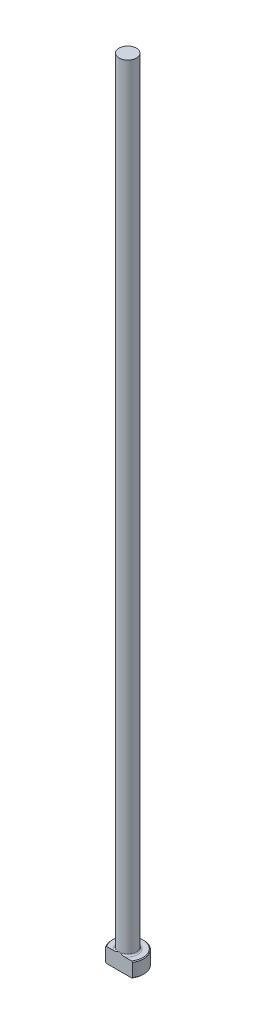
ISO-10303-21;
HEADER;
FILE_DESCRIPTION(('STEP AP214'),'2;1');
FILE_NAME('part.step','',(''),(''),'','','');
FILE_SCHEMA(('AUTOMOTIVE_DESIGN { 1 0 10303 214 1 1 1 1 }'));
ENDSEC;
DATA;
#1=APPLICATION_CONTEXT('core data for automotive mechanical design processes');
#2=APPLICATION_PROTOCOL_DEFINITION('international standard','automotive_design',2000,#1);
#3=PRODUCT_CONTEXT('',#1,'mechanical');
#4=PRODUCT('Part','Part','',(#3));
#5=PRODUCT_RELATED_PRODUCT_CATEGORY('part','',(#4));
#6=PRODUCT_DEFINITION_FORMATION('','',#4);
#7=PRODUCT_DEFINITION_CONTEXT('part definition',#1,'design');
#8=PRODUCT_DEFINITION('design','',#6,#7);
#9=PRODUCT_DEFINITION_SHAPE('','',#8);
#10=(LENGTH_UNIT() NAMED_UNIT(*) SI_UNIT(.MILLI.,.METRE.));
#11=(NAMED_UNIT(*) PLANE_ANGLE_UNIT() SI_UNIT($,.RADIAN.));
#12=(NAMED_UNIT(*) SI_UNIT($,.STERADIAN.) SOLID_ANGLE_UNIT());
#13=UNCERTAINTY_MEASURE_WITH_UNIT(LENGTH_MEASURE(1.E-05),#10,'distance_accuracy_value','');
#14=(GEOMETRIC_REPRESENTATION_CONTEXT(3) GLOBAL_UNCERTAINTY_ASSIGNED_CONTEXT((#13)) GLOBAL_UNIT_ASSIGNED_CONTEXT((#10,
#11,#12)) REPRESENTATION_CONTEXT('',''));
#15=CARTESIAN_POINT('',(0.,0.,0.));
#16=DIRECTION('',(0.,0.,1.));
#17=DIRECTION('',(1.,0.,0.));
#18=AXIS2_PLACEMENT_3D('',#15,#16,#17);
#19=CARTESIAN_POINT('',(0.,0.,0.));
#20=DIRECTION('',(0.,-1.,0.));
#21=DIRECTION('',(0.,0.,-1.));
#22=AXIS2_PLACEMENT_3D('',#19,#20,#21);
#23=PLANE('',#22);
#24=CARTESIAN_POINT('',(0.,0.,0.));
#25=DIRECTION('',(0.,-1.,0.));
#26=DIRECTION('',(0.,0.,-1.));
#27=AXIS2_PLACEMENT_3D('',#24,#25,#26);
#28=CIRCLE('',#27,4.9022);
#29=CARTESIAN_POINT('',(-4.03944478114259,0.,2.77748999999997));
#30=VERTEX_POINT('',#29);
#31=CARTESIAN_POINT('',(4.03944478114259,0.,2.77748999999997));
#32=VERTEX_POINT('',#31);
#33=EDGE_CURVE('E98',#30,#32,#28,.T.);
#34=ORIENTED_EDGE('',*,*,#33,.T.);
#35=DIRECTION('',(-1.,0.,0.));
#36=VECTOR('',#35,1.);
#37=CARTESIAN_POINT('',(-4.34418550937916,0.,2.77748999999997));
#38=LINE('',#37,#36);
#39=EDGE_CURVE('E83',#32,#30,#38,.T.);
#40=ORIENTED_EDGE('',*,*,#39,.T.);
#41=EDGE_LOOP('',(#34,#40));
#42=FACE_BOUND('',#41,.T.);
#43=ADVANCED_FACE('F32',(#42),#23,.T.);
#44=CARTESIAN_POINT('',(0.,259.958771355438,0.));
#45=DIRECTION('',(0.,1.,0.));
#46=DIRECTION('',(0.,0.,1.));
#47=AXIS2_PLACEMENT_3D('',#44,#45,#46);
#48=CYLINDRICAL_SURFACE('',#47,5.15619999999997);
#49=CARTESIAN_POINT('',(0.,4.49579999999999,0.));
#50=DIRECTION('',(0.,1.,0.));
#51=DIRECTION('',(0.,0.,1.));
#52=AXIS2_PLACEMENT_3D('',#49,#50,#51);
#53=CIRCLE('',#52,5.15619999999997);
#54=CARTESIAN_POINT('',(-4.34418550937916,4.49579999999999,2.77748999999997));
#55=VERTEX_POINT('',#54);
#56=CARTESIAN_POINT('',(4.34418550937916,4.49579999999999,2.77748999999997));
#57=VERTEX_POINT('',#56);
#58=EDGE_CURVE('E104',#55,#57,#53,.F.);
#59=ORIENTED_EDGE('',*,*,#58,.T.);
#60=DIRECTION('',(0.,-1.,0.));
#61=VECTOR('',#60,1.);
#62=CARTESIAN_POINT('',(4.34418550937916,254.,2.77748999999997));
#63=LINE('',#62,#61);
#64=CARTESIAN_POINT('',(4.34418550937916,0.253999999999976,2.77748999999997));
#65=VERTEX_POINT('',#64);
#66=EDGE_CURVE('E183',#57,#65,#63,.T.);
#67=ORIENTED_EDGE('',*,*,#66,.T.);
#68=CARTESIAN_POINT('',(0.,0.253999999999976,0.));
#69=DIRECTION('',(0.,-1.,0.));
#70=DIRECTION('',(0.,0.,-1.));
#71=AXIS2_PLACEMENT_3D('',#68,#69,#70);
#72=CIRCLE('',#71,5.15619999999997);
#73=CARTESIAN_POINT('',(-4.34418550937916,0.253999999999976,2.77748999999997));
#74=VERTEX_POINT('',#73);
#75=EDGE_CURVE('E100',#65,#74,#72,.F.);
#76=ORIENTED_EDGE('',*,*,#75,.T.);
#77=DIRECTION('',(0.,-1.,0.));
#78=VECTOR('',#77,1.);
#79=CARTESIAN_POINT('',(-4.34418550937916,254.,2.77748999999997));
#80=LINE('',#79,#78);
#81=EDGE_CURVE('E93',#55,#74,#80,.T.);
#82=ORIENTED_EDGE('',*,*,#81,.F.);
#83=EDGE_LOOP('',(#59,#67,#76,#82));
#84=FACE_BOUND('',#83,.T.);
#85=ADVANCED_FACE('F158',(#84),#48,.T.);
#86=CARTESIAN_POINT('',(-5.15619999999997,4.7498,0.));
#87=DIRECTION('',(0.,1.,0.));
#88=DIRECTION('',(0.,0.,1.));
#89=AXIS2_PLACEMENT_3D('',#86,#87,#88);
#90=PLANE('',#89);
#91=CARTESIAN_POINT('',(0.,4.7498,0.));
#92=DIRECTION('',(0.,1.,0.));
#93=DIRECTION('',(0.,0.,1.));
#94=AXIS2_PLACEMENT_3D('',#91,#92,#93);
#95=CIRCLE('',#94,4.90220000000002);
#96=CARTESIAN_POINT('',(4.03944478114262,4.7498,2.77748999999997));
#97=VERTEX_POINT('',#96);
#98=CARTESIAN_POINT('',(-4.03944478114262,4.7498,2.77748999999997));
#99=VERTEX_POINT('',#98);
#100=EDGE_CURVE('E178',#97,#99,#95,.T.);
#101=ORIENTED_EDGE('',*,*,#100,.T.);
#102=DIRECTION('',(1.,0.,0.));
#103=VECTOR('',#102,1.);
#104=CARTESIAN_POINT('',(-5.15619999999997,4.7498,2.77748999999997));
#105=LINE('',#104,#103);
#106=CARTESIAN_POINT('',(-1.75499112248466,4.74979999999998,2.77748999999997));
#107=VERTEX_POINT('',#106);
#108=EDGE_CURVE('E57',#99,#107,#105,.T.);
#109=ORIENTED_EDGE('',*,*,#108,.T.);
#110=CARTESIAN_POINT('',(0.,4.7498,0.));
#111=DIRECTION('',(0.,1.,0.));
#112=DIRECTION('',(0.,0.,1.));
#113=AXIS2_PLACEMENT_3D('',#110,#111,#112);
#114=CIRCLE('',#113,3.28548999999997);
#115=CARTESIAN_POINT('',(1.75499112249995,4.74979999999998,2.77748999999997));
#116=VERTEX_POINT('',#115);
#117=EDGE_CURVE('E107',#107,#116,#114,.F.);
#118=ORIENTED_EDGE('',*,*,#117,.T.);
#119=EDGE_CURVE('E136',#116,#97,#105,.T.);
#120=ORIENTED_EDGE('',*,*,#119,.T.);
#121=EDGE_LOOP('',(#101,#109,#118,#120));
#122=FACE_BOUND('',#121,.T.);
#123=ADVANCED_FACE('F147',(#122),#90,.T.);
#124=CARTESIAN_POINT('',(0.,4.74980000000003,0.));
#125=DIRECTION('',(0.,-1.,0.));
#126=DIRECTION('',(0.,0.,-1.));
#127=AXIS2_PLACEMENT_3D('',#124,#125,#126);
#128=CONICAL_SURFACE('',#127,4.9022,0.785398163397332);
#129=ORIENTED_EDGE('',*,*,#58,.F.);
#130=CARTESIAN_POINT('',(-9.55963531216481,-0.302952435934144,2.77748999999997));
#131=CARTESIAN_POINT('',(-9.37135034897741,-0.122152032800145,2.77748999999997));
#132=CARTESIAN_POINT('',(-9.18286469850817,0.0584399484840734,2.77748999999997));
#133=CARTESIAN_POINT('',(-8.80539641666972,0.419106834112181,2.77748999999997));
#134=CARTESIAN_POINT('',(-8.61641378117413,0.599181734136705,2.77748999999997));
#135=CARTESIAN_POINT('',(-8.23780363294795,0.958763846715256,2.77748999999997));
#136=CARTESIAN_POINT('',(-8.04817594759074,1.13827087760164,2.77748999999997));
#137=CARTESIAN_POINT('',(-7.66820393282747,1.49652400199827,2.77748999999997));
#138=CARTESIAN_POINT('',(-7.47785960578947,1.67527009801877,2.77748999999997));
#139=CARTESIAN_POINT('',(-7.09861750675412,2.02964380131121,2.77748999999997));
#140=CARTESIAN_POINT('',(-6.90973042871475,2.20528284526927,2.77748999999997));
#141=CARTESIAN_POINT('',(-6.53088645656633,2.55540305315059,2.77748999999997));
#142=CARTESIAN_POINT('',(-6.34092956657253,2.72988422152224,2.77748999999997));
#143=CARTESIAN_POINT('',(-5.95968564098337,3.07734070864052,2.77748999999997));
#144=CARTESIAN_POINT('',(-5.76839877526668,3.25031621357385,2.77748999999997));
#145=CARTESIAN_POINT('',(-5.3840855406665,3.59432147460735,2.77748999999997));
#146=CARTESIAN_POINT('',(-5.19105920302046,3.7653512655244,2.77748999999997));
#147=CARTESIAN_POINT('',(-4.84259460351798,4.06992471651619,2.77748999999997));
#148=CARTESIAN_POINT('',(-4.6875797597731,4.20395211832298,2.77748999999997));
#149=CARTESIAN_POINT('',(-4.37569692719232,4.46986504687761,2.77748999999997));
#150=CARTESIAN_POINT('',(-4.21882878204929,4.60175039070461,2.77748999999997));
#151=CARTESIAN_POINT('',(-3.90151974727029,4.86365914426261,2.77748999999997));
#152=CARTESIAN_POINT('',(-3.74106073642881,4.99366069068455,2.77748999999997));
#153=CARTESIAN_POINT('',(-3.41702456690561,5.24965567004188,2.77748999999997));
#154=CARTESIAN_POINT('',(-3.25344811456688,5.37564999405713,2.77748999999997));
#155=CARTESIAN_POINT('',(-2.9201807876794,5.62344221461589,2.77748999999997));
#156=CARTESIAN_POINT('',(-2.75044139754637,5.74517569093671,2.77748999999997));
#157=CARTESIAN_POINT('',(-2.49133655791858,5.92141891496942,2.77748999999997));
#158=CARTESIAN_POINT('',(-2.40416054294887,5.979142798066,2.77748999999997));
#159=CARTESIAN_POINT('',(-2.22809424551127,6.09190571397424,2.77748999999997));
#160=CARTESIAN_POINT('',(-2.13920410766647,6.14694497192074,2.77748999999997));
#161=CARTESIAN_POINT('',(-1.96016003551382,6.25324529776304,2.77748999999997));
#162=CARTESIAN_POINT('',(-1.87002259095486,6.30453380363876,2.77748999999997));
#163=CARTESIAN_POINT('',(-1.68751963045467,6.40295882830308,2.77748999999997));
#164=CARTESIAN_POINT('',(-1.59515373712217,6.45009463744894,2.77748999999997));
#165=CARTESIAN_POINT('',(-1.31465582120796,6.58349576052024,2.77748999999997));
#166=CARTESIAN_POINT('',(-1.12257968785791,6.66209225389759,2.77748999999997));
#167=CARTESIAN_POINT('',(-0.832011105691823,6.75391692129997,2.77748999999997));
#168=CARTESIAN_POINT('',(-0.737496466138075,6.77977348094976,2.77748999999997));
#169=CARTESIAN_POINT('',(-0.546475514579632,6.82278925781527,2.77748999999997));
#170=CARTESIAN_POINT('',(-0.449969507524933,6.8399497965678,2.77748999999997));
#171=CARTESIAN_POINT('',(-0.25621872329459,6.8643623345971,2.77748999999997));
#172=CARTESIAN_POINT('',(-0.158980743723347,6.87166730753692,2.77748999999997));
#173=CARTESIAN_POINT('',(0.0357279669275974,6.87598550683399,2.77748999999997));
#174=CARTESIAN_POINT('',(0.133198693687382,6.87299892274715,2.77748999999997));
#175=CARTESIAN_POINT('',(0.32694420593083,6.85699585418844,2.77748999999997));
#176=CARTESIAN_POINT('',(0.423222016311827,6.84401516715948,2.77748999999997));
#177=CARTESIAN_POINT('',(0.61411978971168,6.80897777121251,2.77748999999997));
#178=CARTESIAN_POINT('',(0.70873904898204,6.78691730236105,2.77748999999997));
#179=CARTESIAN_POINT('',(0.896435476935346,6.73483507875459,2.77748999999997));
#180=CARTESIAN_POINT('',(0.989497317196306,6.70475895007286,2.77748999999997));
#181=CARTESIAN_POINT('',(1.17322201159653,6.63810376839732,2.77748999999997));
#182=CARTESIAN_POINT('',(1.26388499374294,6.60152506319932,2.77748999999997));
#183=CARTESIAN_POINT('',(1.47746511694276,6.50797532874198,2.77748999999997));
#184=CARTESIAN_POINT('',(1.59931597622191,6.44858460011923,2.77748999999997));
#185=CARTESIAN_POINT('',(1.83913088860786,6.32236713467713,2.77748999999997));
#186=CARTESIAN_POINT('',(1.9570924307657,6.25553571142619,2.77748999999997));
#187=CARTESIAN_POINT('',(2.18997865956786,6.11622068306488,2.77748999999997));
#188=CARTESIAN_POINT('',(2.30489556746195,6.04372417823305,2.77748999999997));
#189=CARTESIAN_POINT('',(2.5319660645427,5.89460998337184,2.77748999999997));
#190=CARTESIAN_POINT('',(2.64412028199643,5.8179932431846,2.77748999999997));
#191=CARTESIAN_POINT('',(2.86729042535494,5.6608262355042,2.77748999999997));
#192=CARTESIAN_POINT('',(2.97828414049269,5.58024457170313,2.77748999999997));
#193=CARTESIAN_POINT('',(3.19840564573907,5.41657181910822,2.77748999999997));
#194=CARTESIAN_POINT('',(3.30753335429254,5.33348062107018,2.77748999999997));
#195=CARTESIAN_POINT('',(3.63230478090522,5.08151517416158,2.77748999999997));
#196=CARTESIAN_POINT('',(3.8456705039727,4.90970900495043,2.77748999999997));
#197=CARTESIAN_POINT('',(4.30277208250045,4.53251833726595,2.77748999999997));
#198=CARTESIAN_POINT('',(4.54576364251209,4.32624002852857,2.77748999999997));
#199=CARTESIAN_POINT('',(5.02789686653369,3.90921091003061,2.77748999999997));
#200=CARTESIAN_POINT('',(5.26703820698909,3.69845972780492,2.77748999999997));
#201=CARTESIAN_POINT('',(5.74277905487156,3.27371644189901,2.77748999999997));
#202=CARTESIAN_POINT('',(5.97937625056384,3.05972175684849,2.77748999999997));
#203=CARTESIAN_POINT('',(6.45056510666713,2.62953458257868,2.77748999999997));
#204=CARTESIAN_POINT('',(6.68515674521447,2.41334206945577,2.77748999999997));
#205=CARTESIAN_POINT('',(7.14123520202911,1.99009092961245,2.77748999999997));
#206=CARTESIAN_POINT('',(7.36279506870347,1.7831109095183,2.77748999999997));
#207=CARTESIAN_POINT('',(7.80485250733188,1.36801517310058,2.77748999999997));
#208=CARTESIAN_POINT('',(8.02535006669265,1.15989944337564,2.77748999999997));
#209=CARTESIAN_POINT('',(8.4652013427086,0.743063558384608,2.77748999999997));
#210=CARTESIAN_POINT('',(8.68455621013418,0.534344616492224,2.77748999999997));
#211=CARTESIAN_POINT('',(9.12257454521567,0.116191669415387,2.77748999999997));
#212=CARTESIAN_POINT('',(9.34123802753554,-0.0932423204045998,2.77748999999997));
#213=CARTESIAN_POINT('',(9.55963531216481,-0.302952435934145,2.77748999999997));
#214=B_SPLINE_CURVE_WITH_KNOTS('',3,(#130,#131,#132,#133,#134,#135,#136,#137,#138,#139,#140,
#141,#142,#143,#144,#145,#146,#147,#148,#149,#150,#151,#152,#153,#154,#155,#156,#157,#158,#159,
#160,#161,#162,#163,#164,#165,#166,#167,#168,#169,#170,#171,#172,#173,#174,#175,#176,#177,#178,
#179,#180,#181,#182,#183,#184,#185,#186,#187,#188,#189,#190,#191,#192,#193,#194,#195,#196,#197,
#198,#199,#200,#201,#202,#203,#204,#205,#206,#207,#208,#209,#210,#211,#212,#213),.UNSPECIFIED.,
.F.,.F.,(4,2,2,2,2,2,2,2,2,2,2,2,2,2,2,2,2,2,2,2,2,2,2,2,2,2,2,2,2,2,2,2,2,2,2,2,2,2,2,2,2,4),
(0.,0.783109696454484,1.56622591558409,2.3495714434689,3.13291438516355,3.90669782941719,
4.68047829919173,5.45416168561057,6.22783120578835,6.84258177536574,7.45738456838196,
8.07687494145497,8.69622658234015,9.32265693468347,9.63628229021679,9.94988129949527,
10.2608915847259,10.5719549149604,11.192167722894,11.4858060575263,11.7793997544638,
12.0714090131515,12.3634128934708,12.6543756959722,12.9454591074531,13.2385696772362,
13.5316645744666,13.9379559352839,14.3445046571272,14.752007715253,15.1594172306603,
15.5708539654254,15.9823086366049,16.8039855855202,17.7601331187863,18.7163605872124,
19.673393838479,20.6304375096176,21.5400289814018,22.4496312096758,23.3579913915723,
24.2663321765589),.UNSPECIFIED.);
#215=EDGE_CURVE('E135',#55,#99,#214,.T.);
#216=ORIENTED_EDGE('',*,*,#215,.T.);
#217=ORIENTED_EDGE('',*,*,#100,.F.);
#218=EDGE_CURVE('E127',#97,#57,#214,.T.);
#219=ORIENTED_EDGE('',*,*,#218,.T.);
#220=EDGE_LOOP('',(#129,#216,#217,#219));
#221=FACE_BOUND('',#220,.T.);
#222=ADVANCED_FACE('F143',(#221),#128,.T.);
#223=CARTESIAN_POINT('',(0.,0.253999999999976,0.));
#224=DIRECTION('',(0.,1.,0.));
#225=DIRECTION('',(0.,0.,1.));
#226=AXIS2_PLACEMENT_3D('',#223,#224,#225);
#227=CONICAL_SURFACE('',#226,5.15619999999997,0.785398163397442);
#228=ORIENTED_EDGE('',*,*,#75,.F.);
#229=CARTESIAN_POINT('',(9.55963531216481,5.05275243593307,2.77748999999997));
#230=CARTESIAN_POINT('',(9.37135034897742,4.87195203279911,2.77748999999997));
#231=CARTESIAN_POINT('',(9.18286469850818,4.69136005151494,2.77748999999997));
#232=CARTESIAN_POINT('',(8.80539641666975,4.33069316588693,2.77748999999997));
#233=CARTESIAN_POINT('',(8.61641378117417,4.15061826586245,2.77748999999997));
#234=CARTESIAN_POINT('',(8.23780363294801,3.79103615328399,2.77748999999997));
#235=CARTESIAN_POINT('',(8.0481759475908,3.61152912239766,2.77748999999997));
#236=CARTESIAN_POINT('',(7.66820393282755,3.25327599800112,2.77748999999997));
#237=CARTESIAN_POINT('',(7.47785960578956,3.07452990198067,2.77748999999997));
#238=CARTESIAN_POINT('',(7.09861750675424,2.72015619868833,2.77748999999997));
#239=CARTESIAN_POINT('',(6.90973042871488,2.54451715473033,2.77748999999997));
#240=CARTESIAN_POINT('',(6.5308864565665,2.19439694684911,2.77748999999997));
#241=CARTESIAN_POINT('',(6.34092956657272,2.01991577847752,2.77748999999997));
#242=CARTESIAN_POINT('',(5.95968564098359,1.67245929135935,2.77748999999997));
#243=CARTESIAN_POINT('',(5.76839877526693,1.49948378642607,2.77748999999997));
#244=CARTESIAN_POINT('',(5.38408554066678,1.15547852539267,2.77748999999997));
#245=CARTESIAN_POINT('',(5.19105920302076,0.984448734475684,2.77748999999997));
#246=CARTESIAN_POINT('',(4.84259460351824,0.679875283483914,2.77748999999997));
#247=CARTESIAN_POINT('',(4.68757975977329,0.545847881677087,2.77748999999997));
#248=CARTESIAN_POINT('',(4.37569692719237,0.279934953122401,2.77748999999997));
#249=CARTESIAN_POINT('',(4.21882878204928,0.148049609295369,2.77748999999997));
#250=CARTESIAN_POINT('',(3.90151974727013,-0.113859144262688,2.77748999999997));
#251=CARTESIAN_POINT('',(3.74106073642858,-0.243860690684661,2.77748999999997));
#252=CARTESIAN_POINT('',(3.41702456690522,-0.499855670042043,2.77748999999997));
#253=CARTESIAN_POINT('',(3.25344811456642,-0.625849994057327,2.77748999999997));
#254=CARTESIAN_POINT('',(2.92018078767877,-0.873642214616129,2.77748999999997));
#255=CARTESIAN_POINT('',(2.75044139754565,-0.995375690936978,2.77748999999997));
#256=CARTESIAN_POINT('',(2.49133655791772,-1.17161891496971,2.77748999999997));
#257=CARTESIAN_POINT('',(2.40416054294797,-1.2293427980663,2.77748999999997));
#258=CARTESIAN_POINT('',(2.22809424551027,-1.34210571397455,2.77748999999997));
#259=CARTESIAN_POINT('',(2.13920410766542,-1.39714497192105,2.77748999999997));
#260=CARTESIAN_POINT('',(1.96016003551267,-1.50344529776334,2.77748999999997));
#261=CARTESIAN_POINT('',(1.87002259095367,-1.55473380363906,2.77748999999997));
#262=CARTESIAN_POINT('',(1.68751963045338,-1.65315882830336,2.77748999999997));
#263=CARTESIAN_POINT('',(1.59515373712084,-1.70029463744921,2.77748999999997));
#264=CARTESIAN_POINT('',(1.31465582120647,-1.83369576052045,2.77748999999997));
#265=CARTESIAN_POINT('',(1.12257968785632,-1.91229225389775,2.77748999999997));
#266=CARTESIAN_POINT('',(0.832011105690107,-2.0041169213,2.77748999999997));
#267=CARTESIAN_POINT('',(0.737496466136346,-2.02997348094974,2.77748999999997));
#268=CARTESIAN_POINT('',(0.546475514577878,-2.07298925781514,2.77748999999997));
#269=CARTESIAN_POINT('',(0.449969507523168,-2.0901497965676,2.77748999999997));
#270=CARTESIAN_POINT('',(0.256218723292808,-2.11456233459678,2.77748999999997));
#271=CARTESIAN_POINT('',(0.158980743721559,-2.12186730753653,2.77748999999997));
#272=CARTESIAN_POINT('',(-0.0357279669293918,-2.12618550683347,2.77748999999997));
#273=CARTESIAN_POINT('',(-0.133198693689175,-2.12319892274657,2.77748999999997));
#274=CARTESIAN_POINT('',(-0.326944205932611,-2.10719585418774,2.77748999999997));
#275=CARTESIAN_POINT('',(-0.423222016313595,-2.09421516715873,2.77748999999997));
#276=CARTESIAN_POINT('',(-0.61411978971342,-2.05917777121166,2.77748999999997));
#277=CARTESIAN_POINT('',(-0.708739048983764,-2.03711730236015,2.77748999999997));
#278=CARTESIAN_POINT('',(-0.896435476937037,-1.98503507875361,2.77748999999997));
#279=CARTESIAN_POINT('',(-0.98949731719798,-1.95495895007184,2.77748999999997));
#280=CARTESIAN_POINT('',(-1.17322201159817,-1.88830376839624,2.77748999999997));
#281=CARTESIAN_POINT('',(-1.26388499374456,-1.85172506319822,2.77748999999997));
#282=CARTESIAN_POINT('',(-1.47746511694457,-1.75817532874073,2.77748999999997));
#283=CARTESIAN_POINT('',(-1.5993159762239,-1.69878460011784,2.77748999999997));
#284=CARTESIAN_POINT('',(-1.83913088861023,-1.57256713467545,2.77748999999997));
#285=CARTESIAN_POINT('',(-1.95709243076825,-1.50573571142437,2.77748999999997));
#286=CARTESIAN_POINT('',(-2.18997865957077,-1.36642068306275,2.77748999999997));
#287=CARTESIAN_POINT('',(-2.30489556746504,-1.29392417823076,2.77748999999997));
#288=CARTESIAN_POINT('',(-2.53196606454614,-1.14480998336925,2.77748999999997));
#289=CARTESIAN_POINT('',(-2.64412028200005,-1.06819324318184,2.77748999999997));
#290=CARTESIAN_POINT('',(-2.8672904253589,-0.91102623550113,2.77748999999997));
#291=CARTESIAN_POINT('',(-2.97828414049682,-0.830444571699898,2.77748999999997));
#292=CARTESIAN_POINT('',(-3.19840564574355,-0.666771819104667,2.77748999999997));
#293=CARTESIAN_POINT('',(-3.30753335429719,-0.583680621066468,2.77748999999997));
#294=CARTESIAN_POINT('',(-3.63230478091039,-0.331715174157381,2.77748999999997));
#295=CARTESIAN_POINT('',(-3.8456705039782,-0.159909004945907,2.77748999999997));
#296=CARTESIAN_POINT('',(-4.30277208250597,0.217281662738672,2.77748999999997));
#297=CARTESIAN_POINT('',(-4.5457636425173,0.423559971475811,2.77748999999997));
#298=CARTESIAN_POINT('',(-5.0278968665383,0.840589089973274,2.77748999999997));
#299=CARTESIAN_POINT('',(-5.26703820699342,1.0513402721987,2.77748999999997));
#300=CARTESIAN_POINT('',(-5.74277905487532,1.47608355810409,2.77748999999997));
#301=CARTESIAN_POINT('',(-5.97937625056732,1.69007824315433,2.77748999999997));
#302=CARTESIAN_POINT('',(-6.45056510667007,2.12026541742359,2.77748999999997));
#303=CARTESIAN_POINT('',(-6.68515674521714,2.33645793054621,2.77748999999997));
#304=CARTESIAN_POINT('',(-7.14123520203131,2.75970907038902,2.77748999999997));
#305=CARTESIAN_POINT('',(-7.36279506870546,2.96668909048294,2.77748999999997));
#306=CARTESIAN_POINT('',(-7.80485250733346,3.3817848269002,2.77748999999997));
#307=CARTESIAN_POINT('',(-8.02535006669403,3.58990055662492,2.77748999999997));
#308=CARTESIAN_POINT('',(-8.46520134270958,4.00673644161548,2.77748999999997));
#309=CARTESIAN_POINT('',(-8.68455621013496,4.21545538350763,2.77748999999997));
#310=CARTESIAN_POINT('',(-9.12257454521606,4.633608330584,2.77748999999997));
#311=CARTESIAN_POINT('',(-9.34123802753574,4.84304232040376,2.77748999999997));
#312=CARTESIAN_POINT('',(-9.55963531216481,5.05275243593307,2.77748999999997));
#313=B_SPLINE_CURVE_WITH_KNOTS('',3,(#229,#230,#231,#232,#233,#234,#235,#236,#237,#238,#239,
#240,#241,#242,#243,#244,#245,#246,#247,#248,#249,#250,#251,#252,#253,#254,#255,#256,#257,#258,
#259,#260,#261,#262,#263,#264,#265,#266,#267,#268,#269,#270,#271,#272,#273,#274,#275,#276,#277,
#278,#279,#280,#281,#282,#283,#284,#285,#286,#287,#288,#289,#290,#291,#292,#293,#294,#295,#296,
#297,#298,#299,#300,#301,#302,#303,#304,#305,#306,#307,#308,#309,#310,#311,#312),.UNSPECIFIED.,
.F.,.F.,(4,2,2,2,2,2,2,2,2,2,2,2,2,2,2,2,2,2,2,2,2,2,2,2,2,2,2,2,2,2,2,2,2,2,2,2,2,2,2,2,2,4),
(0.,0.78310969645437,1.56622591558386,2.34957144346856,3.13291438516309,3.90669782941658,
4.68047829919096,5.45416168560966,6.22783120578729,6.84258177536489,7.45738456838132,
8.07687494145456,8.69622658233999,9.32265693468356,9.63628229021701,9.94988129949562,
10.2608915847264,10.571954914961,11.1921677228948,11.4858060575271,11.7793997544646,
12.0714090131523,12.3634128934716,12.654375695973,12.9454591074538,13.238569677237,
13.5316645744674,13.9379559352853,14.3445046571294,14.7520077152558,15.1594172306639,
15.5708539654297,15.9823086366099,16.8039855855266,17.7601331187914,18.7163605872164,
19.6733938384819,20.6304375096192,21.5400289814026,22.4496312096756,23.3579913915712,
24.266332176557),.UNSPECIFIED.);
#314=EDGE_CURVE('E86',#65,#32,#313,.T.);
#315=ORIENTED_EDGE('',*,*,#314,.T.);
#316=ORIENTED_EDGE('',*,*,#33,.F.);
#317=EDGE_CURVE('E89',#30,#74,#313,.T.);
#318=ORIENTED_EDGE('',*,*,#317,.T.);
#319=EDGE_LOOP('',(#228,#315,#316,#318));
#320=FACE_BOUND('',#319,.T.);
#321=ADVANCED_FACE('F97',(#320),#227,.T.);
#322=CARTESIAN_POINT('',(0.,5.25779999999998,0.));
#323=DIRECTION('',(0.,1.,0.));
#324=DIRECTION('',(0.,0.,1.));
#325=AXIS2_PLACEMENT_3D('',#322,#323,#324);
#326=TOROIDAL_SURFACE('',#325,3.28548999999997,0.508);
#327=CARTESIAN_POINT('',(0.,5.25779999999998,2.77748999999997));
#328=CARTESIAN_POINT('',(-3.63482500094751E-11,5.25780081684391,2.77748999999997));
#329=CARTESIAN_POINT('',(1.58527088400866E-07,5.25780163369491,2.77748999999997));
#330=CARTESIAN_POINT('',(6.68759389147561E-07,5.2578032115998,2.77748999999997));
#331=CARTESIAN_POINT('',(1.02470275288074E-06,5.2578039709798,2.77748999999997));
#332=CARTESIAN_POINT('',(1.88230728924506E-06,5.25780548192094,2.77748999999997));
#333=CARTESIAN_POINT('',(2.39329363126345E-06,5.25780622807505,2.77748999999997));
#334=CARTESIAN_POINT('',(3.50054720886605E-06,5.25780764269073,2.77748999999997));
#335=CARTESIAN_POINT('',(4.09620351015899E-06,5.25780831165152,2.77748999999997));
#336=CARTESIAN_POINT('',(6.21505862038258E-06,5.25781052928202,2.77748999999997));
#337=CARTESIAN_POINT('',(7.84997964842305E-06,5.25781197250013,2.77748999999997));
#338=CARTESIAN_POINT('',(1.12461435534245E-05,5.25781456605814,2.77748999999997));
#339=CARTESIAN_POINT('',(1.30017650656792E-05,5.25781572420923,2.77748999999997));
#340=CARTESIAN_POINT('',(1.97830813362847E-05,5.25782001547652,2.77748999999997));
#341=CARTESIAN_POINT('',(2.49606936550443E-05,5.25782291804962,2.77748999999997));
#342=CARTESIAN_POINT('',(3.52264964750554E-05,5.25782772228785,2.77748999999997));
#343=CARTESIAN_POINT('',(4.02861099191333E-05,5.25782968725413,2.77748999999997));
#344=CARTESIAN_POINT('',(6.16428547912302E-05,5.25783793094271,2.77748999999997));
#345=CARTESIAN_POINT('',(7.79686338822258E-05,5.25784410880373,2.77748999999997));
#346=CARTESIAN_POINT('',(0.000108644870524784,5.2578541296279,2.77748999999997));
#347=CARTESIAN_POINT('',(0.000122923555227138,5.25785818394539,2.77748999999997));
#348=CARTESIAN_POINT('',(0.00022589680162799,5.25789001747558,2.77748999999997));
#349=CARTESIAN_POINT('',(0.000310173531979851,5.25793021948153,2.77748999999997));
#350=CARTESIAN_POINT('',(0.000636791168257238,5.25808026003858,2.77748999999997));
#351=CARTESIAN_POINT('',(0.00088220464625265,5.25818086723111,2.77748999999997));
#352=CARTESIAN_POINT('',(0.00183112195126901,5.25857573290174,2.77748999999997));
#353=CARTESIAN_POINT('',(0.00253146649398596,5.25887966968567,2.77748999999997));
#354=CARTESIAN_POINT('',(0.00538269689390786,5.26011107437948,2.77748999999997));
#355=CARTESIAN_POINT('',(0.00753706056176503,5.2610276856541,2.77748999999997));
#356=CARTESIAN_POINT('',(0.0523267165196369,5.2800917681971,2.77748999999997));
#357=CARTESIAN_POINT('',(0.0949226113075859,5.29836433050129,2.77748999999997));
#358=CARTESIAN_POINT('',(0.178660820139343,5.33400805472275,2.77748999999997));
#359=CARTESIAN_POINT('',(0.219799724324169,5.35138784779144,2.77748999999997));
#360=CARTESIAN_POINT('',(0.30692560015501,5.38783884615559,2.77748999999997));
#361=CARTESIAN_POINT('',(0.352927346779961,5.40687537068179,2.77748999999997));
#362=CARTESIAN_POINT('',(0.445632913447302,5.44454742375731,2.77748999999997));
#363=CARTESIAN_POINT('',(0.492339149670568,5.46317702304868,2.77748999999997));
#364=CARTESIAN_POINT('',(0.574123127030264,5.4949722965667,2.77748999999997));
#365=CARTESIAN_POINT('',(0.609129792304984,5.50832012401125,2.77748999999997));
#366=CARTESIAN_POINT('',(0.679265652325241,5.53442851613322,2.77748999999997));
#367=CARTESIAN_POINT('',(0.714394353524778,5.54719040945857,2.77748999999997));
#368=CARTESIAN_POINT('',(0.818611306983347,5.58395598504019,2.77748999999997));
#369=CARTESIAN_POINT('',(0.888033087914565,5.60703279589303,2.77748999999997));
#370=CARTESIAN_POINT('',(1.01885178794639,5.64701930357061,2.77748999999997));
#371=CARTESIAN_POINT('',(1.0801217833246,5.66434067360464,2.77748999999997));
#372=CARTESIAN_POINT('',(1.20389830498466,5.69582437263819,2.77748999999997));
#373=CARTESIAN_POINT('',(1.26641022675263,5.70996583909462,2.77748999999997));
#374=CARTESIAN_POINT('',(1.39563114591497,5.73475443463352,2.77748999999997));
#375=CARTESIAN_POINT('',(1.46238514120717,5.74517289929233,2.77748999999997));
#376=CARTESIAN_POINT('',(1.5964208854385,5.76016238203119,2.77748999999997));
#377=CARTESIAN_POINT('',(1.6637008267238,5.76474842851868,2.77748999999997));
#378=CARTESIAN_POINT('',(1.78334896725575,5.76633336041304,2.77748999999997));
#379=CARTESIAN_POINT('',(1.83569286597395,5.76479753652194,2.77748999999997));
#380=CARTESIAN_POINT('',(1.93953534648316,5.75634035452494,2.77748999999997));
#381=CARTESIAN_POINT('',(1.99103732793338,5.74946529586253,2.77748999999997));
#382=CARTESIAN_POINT('',(2.09352832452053,5.72907082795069,2.77748999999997));
#383=CARTESIAN_POINT('',(2.14449935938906,5.71545744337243,2.77748999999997));
#384=CARTESIAN_POINT('',(2.2436267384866,5.67996337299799,2.77748999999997));
#385=CARTESIAN_POINT('',(2.29178599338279,5.65809141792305,2.77748999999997));
#386=CARTESIAN_POINT('',(2.36178980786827,5.61652411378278,2.77748999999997));
#387=CARTESIAN_POINT('',(2.38569818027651,5.60030457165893,2.77748999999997));
#388=CARTESIAN_POINT('',(2.4309629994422,5.56461281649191,2.77748999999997));
#389=CARTESIAN_POINT('',(2.45232270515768,5.54514483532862,2.77748999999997));
#390=CARTESIAN_POINT('',(2.48830742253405,5.50626208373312,2.77748999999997));
#391=CARTESIAN_POINT('',(2.50346308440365,5.48734205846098,2.77748999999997));
#392=CARTESIAN_POINT('',(2.53047517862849,5.44726495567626,2.77748999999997));
#393=CARTESIAN_POINT('',(2.5423352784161,5.42611040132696,2.77748999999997));
#394=CARTESIAN_POINT('',(2.56038418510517,5.3854866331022,2.77748999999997));
#395=CARTESIAN_POINT('',(2.56717564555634,5.36628626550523,2.77748999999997));
#396=CARTESIAN_POINT('',(2.57744003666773,5.32701469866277,2.77748999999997));
#397=CARTESIAN_POINT('',(2.58091477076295,5.30694397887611,2.77748999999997));
#398=CARTESIAN_POINT('',(2.58430568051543,5.2664504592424,2.77748999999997));
#399=CARTESIAN_POINT('',(2.584213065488,5.24602691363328,2.77748999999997));
#400=CARTESIAN_POINT('',(2.5804545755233,5.20551288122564,2.77748999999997));
#401=CARTESIAN_POINT('',(2.57678819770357,5.18542244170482,2.77748999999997));
#402=CARTESIAN_POINT('',(2.56632842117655,5.14683425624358,2.77748999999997));
#403=CARTESIAN_POINT('',(2.55964787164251,5.12830543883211,2.77748999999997));
#404=CARTESIAN_POINT('',(2.54358717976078,5.09246829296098,2.77748999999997));
#405=CARTESIAN_POINT('',(2.53420613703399,5.07516037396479,2.77748999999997));
#406=CARTESIAN_POINT('',(2.50902920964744,5.03545005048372,2.77748999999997));
#407=CARTESIAN_POINT('',(2.49216203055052,5.01372616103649,2.77748999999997));
#408=CARTESIAN_POINT('',(2.45513239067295,4.97328752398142,2.77748999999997));
#409=CARTESIAN_POINT('',(2.43496232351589,4.95457992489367,2.77748999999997));
#410=CARTESIAN_POINT('',(2.38311067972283,4.912743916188,2.77748999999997));
#411=CARTESIAN_POINT('',(2.35019661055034,4.89114952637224,2.77748999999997));
#412=CARTESIAN_POINT('',(2.28149859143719,4.85339659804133,2.77748999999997));
#413=CARTESIAN_POINT('',(2.24571462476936,4.83723809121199,2.77748999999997));
#414=CARTESIAN_POINT('',(2.15091163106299,4.80145440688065,2.77748999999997));
#415=CARTESIAN_POINT('',(2.09057342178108,4.7853535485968,2.77748999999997));
#416=CARTESIAN_POINT('',(1.96762393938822,4.76220444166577,2.77748999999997));
#417=CARTESIAN_POINT('',(1.90499415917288,4.75526622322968,2.77748999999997));
#418=CARTESIAN_POINT('',(1.78440975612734,4.74902507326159,2.77748999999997));
#419=CARTESIAN_POINT('',(1.72647978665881,4.74915837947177,2.77748999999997));
#420=CARTESIAN_POINT('',(1.61075698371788,4.75449180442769,2.77748999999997));
#421=CARTESIAN_POINT('',(1.55296472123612,4.75970292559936,2.77748999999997));
#422=CARTESIAN_POINT('',(1.44056033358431,4.77392629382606,2.77748999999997));
#423=CARTESIAN_POINT('',(1.38592386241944,4.78275336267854,2.77748999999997));
#424=CARTESIAN_POINT('',(1.27754428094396,4.8034547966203,2.77748999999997));
#425=CARTESIAN_POINT('',(1.22379796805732,4.81531273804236,2.77748999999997));
#426=CARTESIAN_POINT('',(1.08372355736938,4.84970148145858,2.77748999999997));
#427=CARTESIAN_POINT('',(0.997900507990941,4.87428584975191,2.77748999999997));
#428=CARTESIAN_POINT('',(0.869412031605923,4.91500035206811,2.77748999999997));
#429=CARTESIAN_POINT('',(0.826169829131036,4.9293839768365,2.77748999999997));
#430=CARTESIAN_POINT('',(0.739936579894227,4.95921802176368,2.77748999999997));
#431=CARTESIAN_POINT('',(0.696946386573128,4.97467092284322,2.77748999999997));
#432=CARTESIAN_POINT('',(0.59684372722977,5.0117644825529,2.77748999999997));
#433=CARTESIAN_POINT('',(0.539854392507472,5.03373544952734,2.77748999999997));
#434=CARTESIAN_POINT('',(0.426869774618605,5.07852412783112,2.77748999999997));
#435=CARTESIAN_POINT('',(0.370870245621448,5.1013312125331,2.77748999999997));
#436=CARTESIAN_POINT('',(0.264915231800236,5.14523941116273,2.77748999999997));
#437=CARTESIAN_POINT('',(0.214932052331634,5.16627387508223,2.77748999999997));
#438=CARTESIAN_POINT('',(0.138912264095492,5.19849280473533,2.77748999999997));
#439=CARTESIAN_POINT('',(0.112835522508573,5.20958556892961,2.77748999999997));
#440=CARTESIAN_POINT('',(0.061077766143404,5.23169621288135,2.77748999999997));
#441=CARTESIAN_POINT('',(0.0353963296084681,5.24271296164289,2.77748999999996));
#442=CARTESIAN_POINT('',(0.00753653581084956,5.25457265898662,2.77748999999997));
#443=CARTESIAN_POINT('',(0.00538158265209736,5.25548941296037,2.77748999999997));
#444=CARTESIAN_POINT('',(0.00253020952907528,5.25672086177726,2.77748999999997));
#445=CARTESIAN_POINT('',(0.00183028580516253,5.25702462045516,2.77748999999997));
#446=CARTESIAN_POINT('',(0.000881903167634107,5.25741926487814,2.77748999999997));
#447=CARTESIAN_POINT('',(0.000636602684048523,5.25751982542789,2.77748999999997));
#448=CARTESIAN_POINT('',(0.000310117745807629,5.25766980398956,2.77748999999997));
#449=CARTESIAN_POINT('',(0.00022586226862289,5.2577099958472,2.77748999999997));
#450=CARTESIAN_POINT('',(0.000122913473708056,5.25774182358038,2.77748999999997));
#451=CARTESIAN_POINT('',(0.000108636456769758,5.25774587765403,2.77748999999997));
#452=CARTESIAN_POINT('',(7.79638534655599E-05,5.25775589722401,2.77748999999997));
#453=CARTESIAN_POINT('',(6.16399948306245E-05,5.25776207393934,2.77748999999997));
#454=CARTESIAN_POINT('',(4.02854070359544E-05,5.2577703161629,2.77748999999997));
#455=CARTESIAN_POINT('',(3.52260605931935E-05,5.25777228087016,2.77748999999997));
#456=CARTESIAN_POINT('',(2.49607548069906E-05,5.25777708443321,2.77748999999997));
#457=CARTESIAN_POINT('',(1.97833634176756E-05,5.25777998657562,2.77748999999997));
#458=CARTESIAN_POINT('',(1.30022515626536E-05,5.25778427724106,2.77748999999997));
#459=CARTESIAN_POINT('',(1.12466510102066E-05,5.25778543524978,2.77748999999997));
#460=CARTESIAN_POINT('',(7.85050041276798E-06,5.25778802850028,2.77748999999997));
#461=CARTESIAN_POINT('',(6.21557048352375E-06,5.25778947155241,2.77748999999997));
#462=CARTESIAN_POINT('',(4.0966688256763E-06,5.25779168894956,2.77748999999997));
#463=CARTESIAN_POINT('',(3.500992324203E-06,5.25779235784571,2.77748999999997));
#464=CARTESIAN_POINT('',(2.3936868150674E-06,5.25779377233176,2.77748999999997));
#465=CARTESIAN_POINT('',(1.88266863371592E-06,5.25779451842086,2.77748999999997));
#466=CARTESIAN_POINT('',(1.02498698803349E-06,5.25779602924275,2.77748999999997));
#467=CARTESIAN_POINT('',(6.6899975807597E-07,5.25779678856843,2.77748999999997));
#468=CARTESIAN_POINT('',(1.58661369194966E-07,5.25779836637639,2.77748999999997));
#469=CARTESIAN_POINT('',(3.63469769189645E-11,5.25779918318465,2.77748999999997));
#470=CARTESIAN_POINT('',(0.,5.25779999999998,2.77748999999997));
#471=B_SPLINE_CURVE_WITH_KNOTS('',3,(#327,#328,#329,#330,#331,#332,#333,#334,#335,#336,#337,
#338,#339,#340,#341,#342,#343,#344,#345,#346,#347,#348,#349,#350,#351,#352,#353,#354,#355,#356,
#357,#358,#359,#360,#361,#362,#363,#364,#365,#366,#367,#368,#369,#370,#371,#372,#373,#374,#375,
#376,#377,#378,#379,#380,#381,#382,#383,#384,#385,#386,#387,#388,#389,#390,#391,#392,#393,#394,
#395,#396,#397,#398,#399,#400,#401,#402,#403,#404,#405,#406,#407,#408,#409,#410,#411,#412,#413,
#414,#415,#416,#417,#418,#419,#420,#421,#422,#423,#424,#425,#426,#427,#428,#429,#430,#431,#432,
#433,#434,#435,#436,#437,#438,#439,#440,#441,#442,#443,#444,#445,#446,#447,#448,#449,#450,#451,
#452,#453,#454,#455,#456,#457,#458,#459,#460,#461,#462,#463,#464,#465,#466,#467,#468,#469,#470),
.UNSPECIFIED.,.T.,.F.,(4,2,2,2,2,2,2,2,2,2,2,2,2,2,2,2,2,2,2,2,2,2,2,2,2,2,2,2,2,2,2,2,2,2,2,2,
2,2,2,2,2,2,2,2,2,2,2,2,2,2,2,2,2,2,2,2,2,2,2,2,2,2,2,2,2,2,2,2,2,2,2,4),(0.,
2.44855601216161E-06,4.95233489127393E-06,7.65489052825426E-06,1.03388521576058E-05,
1.68491008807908E-05,2.31537100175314E-05,4.09008862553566E-05,5.71674519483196E-05,
0.000109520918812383,0.000154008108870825,0.000432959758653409,0.00122961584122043,
0.00351878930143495,0.0105437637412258,0.149576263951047,0.283557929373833,0.432909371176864,
0.583757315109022,0.696148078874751,0.808269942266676,1.02766943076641,1.21861436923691,
1.4107776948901,1.61326934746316,1.81523817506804,1.97211643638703,2.12764930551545,
2.28541514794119,2.44301466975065,2.52945892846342,2.61579143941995,2.68824272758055,
2.76061306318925,2.82144775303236,2.88224934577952,2.94320077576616,3.0041607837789,
3.0630067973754,3.12187245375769,3.20392380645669,3.28616684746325,3.40360419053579,
3.52104221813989,3.70735220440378,3.89587975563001,4.06940181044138,4.24330068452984,
4.40922866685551,4.57427590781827,4.84187326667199,4.97858134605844,5.11561799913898,
5.2988358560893,5.48022693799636,5.64291023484,5.72792677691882,5.81175121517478,
5.81877801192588,5.82106581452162,5.82186210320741,5.82214098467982,5.82218546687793,
5.82223781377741,5.82225407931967,5.82227182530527,5.82227812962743,5.82228463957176,
5.82228732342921,5.8222900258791,5.82229252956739,5.82229497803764),.UNSPECIFIED.);
#472=CARTESIAN_POINT('',(0.,5.25779999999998,2.77748999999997));
#473=VERTEX_POINT('',#472);
#474=EDGE_CURVE('E11',#116,#473,#471,.T.);
#475=ORIENTED_EDGE('',*,*,#474,.F.);
#476=ORIENTED_EDGE('',*,*,#117,.F.);
#477=CARTESIAN_POINT('',(0.,5.25779999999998,2.77748999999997));
#478=CARTESIAN_POINT('',(3.63482481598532E-11,5.25779918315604,2.77748999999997));
#479=CARTESIAN_POINT('',(-1.58527088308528E-07,5.25779836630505,2.77748999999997));
#480=CARTESIAN_POINT('',(-6.68759389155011E-07,5.25779678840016,2.77748999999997));
#481=CARTESIAN_POINT('',(-1.02470275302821E-06,5.25779602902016,2.77748999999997));
#482=CARTESIAN_POINT('',(-1.8823072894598E-06,5.25779451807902,2.77748999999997));
#483=CARTESIAN_POINT('',(-2.39329363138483E-06,5.2577937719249,2.77748999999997));
#484=CARTESIAN_POINT('',(-3.50054720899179E-06,5.25779235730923,2.77748999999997));
#485=CARTESIAN_POINT('',(-4.09620351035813E-06,5.25779168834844,2.77748999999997));
#486=CARTESIAN_POINT('',(-6.215058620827E-06,5.25778947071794,2.77748999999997));
#487=CARTESIAN_POINT('',(-7.84997964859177E-06,5.25778802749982,2.77748999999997));
#488=CARTESIAN_POINT('',(-1.12461435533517E-05,5.25778543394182,2.77748999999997));
#489=CARTESIAN_POINT('',(-1.30017650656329E-05,5.25778427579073,2.77748999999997));
#490=CARTESIAN_POINT('',(-1.97830813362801E-05,5.25777998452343,2.77748999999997));
#491=CARTESIAN_POINT('',(-2.49606936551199E-05,5.25777708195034,2.77748999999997));
#492=CARTESIAN_POINT('',(-3.52264964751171E-05,5.25777227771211,2.77748999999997));
#493=CARTESIAN_POINT('',(-4.02861099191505E-05,5.25777031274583,2.77748999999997));
#494=CARTESIAN_POINT('',(-6.16428547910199E-05,5.25776206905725,2.77748999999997));
#495=CARTESIAN_POINT('',(-7.79686338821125E-05,5.25775589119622,2.77748999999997));
#496=CARTESIAN_POINT('',(-0.000108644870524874,5.25774587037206,2.77748999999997));
#497=CARTESIAN_POINT('',(-0.000122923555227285,5.25774181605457,2.77748999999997));
#498=CARTESIAN_POINT('',(-0.000225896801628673,5.25770998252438,2.77748999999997));
#499=CARTESIAN_POINT('',(-0.000310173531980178,5.25766978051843,2.77748999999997));
#500=CARTESIAN_POINT('',(-0.000636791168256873,5.25751973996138,2.77748999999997));
#501=CARTESIAN_POINT('',(-0.00088220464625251,5.25741913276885,2.77748999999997));
#502=CARTESIAN_POINT('',(-0.00183112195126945,5.25702426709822,2.77748999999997));
#503=CARTESIAN_POINT('',(-0.00253146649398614,5.25672033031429,2.77748999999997));
#504=CARTESIAN_POINT('',(-0.00538269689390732,5.25548892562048,2.77748999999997));
#505=CARTESIAN_POINT('',(-0.00753706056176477,5.25457231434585,2.77748999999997));
#506=CARTESIAN_POINT('',(-0.0523267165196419,5.23550823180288,2.77748999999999));
#507=CARTESIAN_POINT('',(-0.0949226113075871,5.21723566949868,2.77748999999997));
#508=CARTESIAN_POINT('',(-0.178660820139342,5.1815919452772,2.77748999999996));
#509=CARTESIAN_POINT('',(-0.219799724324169,5.16421215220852,2.77748999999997));
#510=CARTESIAN_POINT('',(-0.306925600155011,5.12776115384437,2.77748999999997));
#511=CARTESIAN_POINT('',(-0.352927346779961,5.10872462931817,2.77748999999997));
#512=CARTESIAN_POINT('',(-0.445632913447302,5.07105257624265,2.77748999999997));
#513=CARTESIAN_POINT('',(-0.492339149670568,5.05242297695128,2.77748999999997));
#514=CARTESIAN_POINT('',(-0.574123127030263,5.02062770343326,2.77748999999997));
#515=CARTESIAN_POINT('',(-0.609129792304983,5.00727987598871,2.77748999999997));
#516=CARTESIAN_POINT('',(-0.67926565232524,4.98117148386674,2.77748999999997));
#517=CARTESIAN_POINT('',(-0.714394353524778,4.96840959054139,2.77748999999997));
#518=CARTESIAN_POINT('',(-0.818611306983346,4.93164401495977,2.77748999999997));
#519=CARTESIAN_POINT('',(-0.888033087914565,4.90856720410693,2.77748999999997));
#520=CARTESIAN_POINT('',(-1.01885178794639,4.86858069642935,2.77748999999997));
#521=CARTESIAN_POINT('',(-1.0801217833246,4.85125932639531,2.77748999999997));
#522=CARTESIAN_POINT('',(-1.20389830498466,4.81977562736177,2.77748999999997));
#523=CARTESIAN_POINT('',(-1.26641022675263,4.80563416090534,2.77748999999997));
#524=CARTESIAN_POINT('',(-1.39563114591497,4.78084556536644,2.77748999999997));
#525=CARTESIAN_POINT('',(-1.46238514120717,4.77042710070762,2.77748999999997));
#526=CARTESIAN_POINT('',(-1.5964208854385,4.75543761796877,2.77748999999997));
#527=CARTESIAN_POINT('',(-1.6637008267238,4.75085157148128,2.77748999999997));
#528=CARTESIAN_POINT('',(-1.78334896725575,4.74926663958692,2.77748999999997));
#529=CARTESIAN_POINT('',(-1.83569286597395,4.75080246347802,2.77748999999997));
#530=CARTESIAN_POINT('',(-1.93953534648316,4.75925964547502,2.77748999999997));
#531=CARTESIAN_POINT('',(-1.99103732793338,4.76613470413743,2.77748999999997));
#532=CARTESIAN_POINT('',(-2.09352832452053,4.78652917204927,2.77748999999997));
#533=CARTESIAN_POINT('',(-2.14449935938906,4.80014255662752,2.77748999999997));
#534=CARTESIAN_POINT('',(-2.2436267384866,4.83563662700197,2.77748999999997));
#535=CARTESIAN_POINT('',(-2.29178599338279,4.85750858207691,2.77748999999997));
#536=CARTESIAN_POINT('',(-2.36178980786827,4.89907588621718,2.77748999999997));
#537=CARTESIAN_POINT('',(-2.38569818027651,4.91529542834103,2.77748999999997));
#538=CARTESIAN_POINT('',(-2.4309629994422,4.95098718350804,2.77748999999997));
#539=CARTESIAN_POINT('',(-2.45232270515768,4.97045516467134,2.77748999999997));
#540=CARTESIAN_POINT('',(-2.48830742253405,5.00933791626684,2.77748999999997));
#541=CARTESIAN_POINT('',(-2.50346308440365,5.02825794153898,2.77748999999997));
#542=CARTESIAN_POINT('',(-2.53047517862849,5.0683350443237,2.77748999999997));
#543=CARTESIAN_POINT('',(-2.5423352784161,5.089489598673,2.77748999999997));
#544=CARTESIAN_POINT('',(-2.56038418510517,5.13011336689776,2.77748999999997));
#545=CARTESIAN_POINT('',(-2.56717564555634,5.14931373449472,2.77748999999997));
#546=CARTESIAN_POINT('',(-2.57744003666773,5.18858530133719,2.77748999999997));
#547=CARTESIAN_POINT('',(-2.58091477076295,5.20865602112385,2.77748999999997));
#548=CARTESIAN_POINT('',(-2.58430568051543,5.24914954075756,2.77748999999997));
#549=CARTESIAN_POINT('',(-2.584213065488,5.26957308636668,2.77748999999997));
#550=CARTESIAN_POINT('',(-2.5804545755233,5.31008711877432,2.77748999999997));
#551=CARTESIAN_POINT('',(-2.57678819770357,5.33017755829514,2.77748999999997));
#552=CARTESIAN_POINT('',(-2.56632842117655,5.36876574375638,2.77748999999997));
#553=CARTESIAN_POINT('',(-2.55964787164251,5.38729456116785,2.77748999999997));
#554=CARTESIAN_POINT('',(-2.54358717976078,5.42313170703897,2.77748999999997));
#555=CARTESIAN_POINT('',(-2.53420613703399,5.44043962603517,2.77748999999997));
#556=CARTESIAN_POINT('',(-2.50902920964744,5.48014994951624,2.77748999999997));
#557=CARTESIAN_POINT('',(-2.49216203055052,5.50187383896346,2.77748999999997));
#558=CARTESIAN_POINT('',(-2.45513239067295,5.54231247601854,2.77748999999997));
#559=CARTESIAN_POINT('',(-2.43496232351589,5.56102007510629,2.77748999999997));
#560=CARTESIAN_POINT('',(-2.38311067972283,5.60285608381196,2.77748999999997));
#561=CARTESIAN_POINT('',(-2.35019661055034,5.62445047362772,2.77748999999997));
#562=CARTESIAN_POINT('',(-2.28149859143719,5.66220340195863,2.77748999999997));
#563=CARTESIAN_POINT('',(-2.24571462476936,5.67836190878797,2.77748999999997));
#564=CARTESIAN_POINT('',(-2.15091163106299,5.71414559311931,2.77748999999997));
#565=CARTESIAN_POINT('',(-2.09057342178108,5.73024645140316,2.77748999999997));
#566=CARTESIAN_POINT('',(-1.96762393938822,5.75339555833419,2.77748999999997));
#567=CARTESIAN_POINT('',(-1.90499415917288,5.76033377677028,2.77748999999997));
#568=CARTESIAN_POINT('',(-1.78440975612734,5.76657492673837,2.77748999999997));
#569=CARTESIAN_POINT('',(-1.72647978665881,5.76644162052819,2.77748999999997));
#570=CARTESIAN_POINT('',(-1.61075698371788,5.76110819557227,2.77748999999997));
#571=CARTESIAN_POINT('',(-1.55296472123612,5.7558970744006,2.77748999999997));
#572=CARTESIAN_POINT('',(-1.44056033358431,5.7416737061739,2.77748999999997));
#573=CARTESIAN_POINT('',(-1.38592386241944,5.73284663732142,2.77748999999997));
#574=CARTESIAN_POINT('',(-1.27754428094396,5.71214520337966,2.77748999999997));
#575=CARTESIAN_POINT('',(-1.22379796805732,5.7002872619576,2.77748999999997));
#576=CARTESIAN_POINT('',(-1.08372355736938,5.66589851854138,2.77748999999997));
#577=CARTESIAN_POINT('',(-0.997900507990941,5.64131415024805,2.77748999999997));
#578=CARTESIAN_POINT('',(-0.869412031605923,5.60059964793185,2.77748999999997));
#579=CARTESIAN_POINT('',(-0.826169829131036,5.58621602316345,2.77748999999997));
#580=CARTESIAN_POINT('',(-0.739936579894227,5.55638197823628,2.77748999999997));
#581=CARTESIAN_POINT('',(-0.696946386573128,5.54092907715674,2.77748999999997));
#582=CARTESIAN_POINT('',(-0.59684372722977,5.50383551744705,2.77748999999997));
#583=CARTESIAN_POINT('',(-0.539854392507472,5.48186455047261,2.77748999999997));
#584=CARTESIAN_POINT('',(-0.426869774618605,5.43707587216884,2.77748999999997));
#585=CARTESIAN_POINT('',(-0.370870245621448,5.41426878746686,2.77748999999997));
#586=CARTESIAN_POINT('',(-0.264915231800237,5.37036058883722,2.77748999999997));
#587=CARTESIAN_POINT('',(-0.214932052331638,5.34932612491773,2.77748999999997));
#588=CARTESIAN_POINT('',(-0.138912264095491,5.31710719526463,2.77748999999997));
#589=CARTESIAN_POINT('',(-0.11283552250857,5.30601443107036,2.77748999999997));
#590=CARTESIAN_POINT('',(-0.061077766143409,5.2839037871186,2.77748999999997));
#591=CARTESIAN_POINT('',(-0.0353963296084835,5.27288703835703,2.77748999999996));
#592=CARTESIAN_POINT('',(-0.00753653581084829,5.26102734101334,2.77748999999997));
#593=CARTESIAN_POINT('',(-0.00538158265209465,5.26011058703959,2.77748999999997));
#594=CARTESIAN_POINT('',(-0.00253020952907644,5.2588791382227,2.77748999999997));
#595=CARTESIAN_POINT('',(-0.00183028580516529,5.25857537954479,2.77748999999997));
#596=CARTESIAN_POINT('',(-0.000881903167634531,5.25818073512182,2.77748999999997));
#597=CARTESIAN_POINT('',(-0.000636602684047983,5.25808017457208,2.77748999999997));
#598=CARTESIAN_POINT('',(-0.000310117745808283,5.2579301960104,2.77748999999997));
#599=CARTESIAN_POINT('',(-0.00022586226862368,5.25789000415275,2.77748999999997));
#600=CARTESIAN_POINT('',(-0.000122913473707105,5.25785817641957,2.77748999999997));
#601=CARTESIAN_POINT('',(-0.000108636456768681,5.25785412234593,2.77748999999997));
#602=CARTESIAN_POINT('',(-7.79638534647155E-05,5.25784410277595,2.77748999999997));
#603=CARTESIAN_POINT('',(-6.16399948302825E-05,5.25783792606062,2.77748999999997));
#604=CARTESIAN_POINT('',(-4.02854070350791E-05,5.25782968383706,2.77748999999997));
#605=CARTESIAN_POINT('',(-3.52260605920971E-05,5.2578277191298,2.77748999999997));
#606=CARTESIAN_POINT('',(-2.49607548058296E-05,5.25782291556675,2.77748999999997));
#607=CARTESIAN_POINT('',(-1.97833634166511E-05,5.25782001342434,2.77748999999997));
#608=CARTESIAN_POINT('',(-1.30022515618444E-05,5.25781572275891,2.77748999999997));
#609=CARTESIAN_POINT('',(-1.12466510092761E-05,5.25781456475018,2.77748999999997));
#610=CARTESIAN_POINT('',(-7.85050041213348E-06,5.25781197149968,2.77748999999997));
#611=CARTESIAN_POINT('',(-6.21557048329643E-06,5.25781052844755,2.77748999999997));
#612=CARTESIAN_POINT('',(-4.09666882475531E-06,5.2578083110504,2.77748999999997));
#613=CARTESIAN_POINT('',(-3.50099232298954E-06,5.25780764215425,2.77748999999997));
#614=CARTESIAN_POINT('',(-2.3936868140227E-06,5.25780622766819,2.77748999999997));
#615=CARTESIAN_POINT('',(-1.8826686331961E-06,5.2578054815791,2.77748999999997));
#616=CARTESIAN_POINT('',(-1.02498698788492E-06,5.2578039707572,2.77748999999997));
#617=CARTESIAN_POINT('',(-6.68999757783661E-07,5.25780321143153,2.77748999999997));
#618=CARTESIAN_POINT('',(-1.58661368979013E-07,5.25780163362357,2.77748999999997));
#619=CARTESIAN_POINT('',(-3.63469750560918E-11,5.2578008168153,2.77748999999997));
#620=CARTESIAN_POINT('',(0.,5.25779999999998,2.77748999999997));
#621=B_SPLINE_CURVE_WITH_KNOTS('',3,(#477,#478,#479,#480,#481,#482,#483,#484,#485,#486,#487,
#488,#489,#490,#491,#492,#493,#494,#495,#496,#497,#498,#499,#500,#501,#502,#503,#504,#505,#506,
#507,#508,#509,#510,#511,#512,#513,#514,#515,#516,#517,#518,#519,#520,#521,#522,#523,#524,#525,
#526,#527,#528,#529,#530,#531,#532,#533,#534,#535,#536,#537,#538,#539,#540,#541,#542,#543,#544,
#545,#546,#547,#548,#549,#550,#551,#552,#553,#554,#555,#556,#557,#558,#559,#560,#561,#562,#563,
#564,#565,#566,#567,#568,#569,#570,#571,#572,#573,#574,#575,#576,#577,#578,#579,#580,#581,#582,
#583,#584,#585,#586,#587,#588,#589,#590,#591,#592,#593,#594,#595,#596,#597,#598,#599,#600,#601,
#602,#603,#604,#605,#606,#607,#608,#609,#610,#611,#612,#613,#614,#615,#616,#617,#618,#619,#620),
.UNSPECIFIED.,.T.,.F.,(4,2,2,2,2,2,2,2,2,2,2,2,2,2,2,2,2,2,2,2,2,2,2,2,2,2,2,2,2,2,2,2,2,2,2,2,
2,2,2,2,2,2,2,2,2,2,2,2,2,2,2,2,2,2,2,2,2,2,2,2,2,2,2,2,2,2,2,2,2,2,2,4),(0.,
2.44855601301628E-06,4.95233489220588E-06,7.65489052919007E-06,1.03388521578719E-05,
1.68491008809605E-05,2.31537100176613E-05,4.09008862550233E-05,5.71674519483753E-05,
0.000109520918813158,0.000154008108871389,0.000432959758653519,0.00122961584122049,
0.00351878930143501,0.0105437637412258,0.149576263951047,0.283557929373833,0.432909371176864,
0.583757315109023,0.69614807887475,0.808269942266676,1.02766943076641,1.21861436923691,
1.4107776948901,1.61326934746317,1.81523817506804,1.97211643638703,2.12764930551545,
2.28541514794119,2.44301466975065,2.52945892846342,2.61579143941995,2.68824272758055,
2.76061306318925,2.82144775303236,2.88224934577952,2.94320077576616,3.0041607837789,
3.06300679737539,3.12187245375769,3.20392380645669,3.28616684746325,3.40360419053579,
3.52104221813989,3.70735220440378,3.89587975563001,4.06940181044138,4.24330068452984,
4.4092286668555,4.57427590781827,4.84187326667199,4.97858134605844,5.11561799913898,
5.2988358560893,5.48022693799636,5.64291023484,5.72792677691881,5.81175121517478,
5.81877801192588,5.82106581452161,5.82186210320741,5.82214098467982,5.82218546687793,
5.82223781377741,5.82225407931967,5.82227182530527,5.82227812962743,5.82228463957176,
5.82228732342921,5.8222900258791,5.82229252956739,5.82229497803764),.UNSPECIFIED.);
#622=EDGE_CURVE('E46',#473,#107,#621,.T.);
#623=ORIENTED_EDGE('',*,*,#622,.F.);
#624=CARTESIAN_POINT('',(0.,5.25779999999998,0.));
#625=DIRECTION('',(0.,1.,0.));
#626=DIRECTION('',(0.,0.,1.));
#627=AXIS2_PLACEMENT_3D('',#624,#625,#626);
#628=CIRCLE('',#627,2.77748999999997);
#629=EDGE_CURVE('E103',#473,#473,#628,.T.);
#630=ORIENTED_EDGE('',*,*,#629,.F.);
#631=EDGE_LOOP('',(#475,#476,#623,#630));
#632=FACE_BOUND('',#631,.T.);
#633=ADVANCED_FACE('F34',(#632),#326,.F.);
#634=CARTESIAN_POINT('',(0.,259.958771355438,0.));
#635=DIRECTION('',(0.,1.,0.));
#636=DIRECTION('',(0.,0.,1.));
#637=AXIS2_PLACEMENT_3D('',#634,#635,#636);
#638=CYLINDRICAL_SURFACE('',#637,2.77748999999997);
#639=ORIENTED_EDGE('',*,*,#629,.T.);
#640=EDGE_LOOP('',(#639));
#641=FACE_BOUND('',#640,.T.);
#642=CARTESIAN_POINT('',(0.,254.,0.));
#643=DIRECTION('',(0.,1.,0.));
#644=DIRECTION('',(0.,0.,1.));
#645=AXIS2_PLACEMENT_3D('',#642,#643,#644);
#646=CIRCLE('',#645,2.77748999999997);
#647=CARTESIAN_POINT('',(0.,254.,2.77748999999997));
#648=VERTEX_POINT('',#647);
#649=EDGE_CURVE('E101',#648,#648,#646,.T.);
#650=ORIENTED_EDGE('',*,*,#649,.F.);
#651=EDGE_LOOP('',(#650));
#652=FACE_BOUND('',#651,.T.);
#653=ADVANCED_FACE('F155',(#641,#652),#638,.T.);
#654=CARTESIAN_POINT('',(-2.77748999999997,254.,0.));
#655=DIRECTION('',(0.,1.,0.));
#656=DIRECTION('',(0.,0.,1.));
#657=AXIS2_PLACEMENT_3D('',#654,#655,#656);
#658=PLANE('',#657);
#659=ORIENTED_EDGE('',*,*,#649,.T.);
#660=EDGE_LOOP('',(#659));
#661=FACE_BOUND('',#660,.T.);
#662=ADVANCED_FACE('F121',(#661),#658,.T.);
#663=CARTESIAN_POINT('',(-4.34418550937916,254.,2.77748999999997));
#664=DIRECTION('',(0.,0.,1.));
#665=DIRECTION('',(1.,0.,0.));
#666=AXIS2_PLACEMENT_3D('',#663,#664,#665);
#667=PLANE('',#666);
#668=ORIENTED_EDGE('',*,*,#66,.F.);
#669=ORIENTED_EDGE('',*,*,#218,.F.);
#670=ORIENTED_EDGE('',*,*,#119,.F.);
#671=ORIENTED_EDGE('',*,*,#474,.T.);
#672=ORIENTED_EDGE('',*,*,#622,.T.);
#673=ORIENTED_EDGE('',*,*,#108,.F.);
#674=ORIENTED_EDGE('',*,*,#215,.F.);
#675=ORIENTED_EDGE('',*,*,#81,.T.);
#676=ORIENTED_EDGE('',*,*,#317,.F.);
#677=ORIENTED_EDGE('',*,*,#39,.F.);
#678=ORIENTED_EDGE('',*,*,#314,.F.);
#679=EDGE_LOOP('',(#668,#669,#670,#671,#672,#673,#674,#675,#676,#677,#678));
#680=FACE_BOUND('',#679,.T.);
#681=ADVANCED_FACE('F85',(#680),#667,.T.);
#682=CLOSED_SHELL('',(#43,#85,#123,#222,#321,#633,#653,#662,#681));
#683=MANIFOLD_SOLID_BREP('B2',#682);
#684=ADVANCED_BREP_SHAPE_REPRESENTATION('',(#18,#683),#14);
#685=SHAPE_DEFINITION_REPRESENTATION(#9,#684);
ENDSEC;
END-ISO-10303-21;
